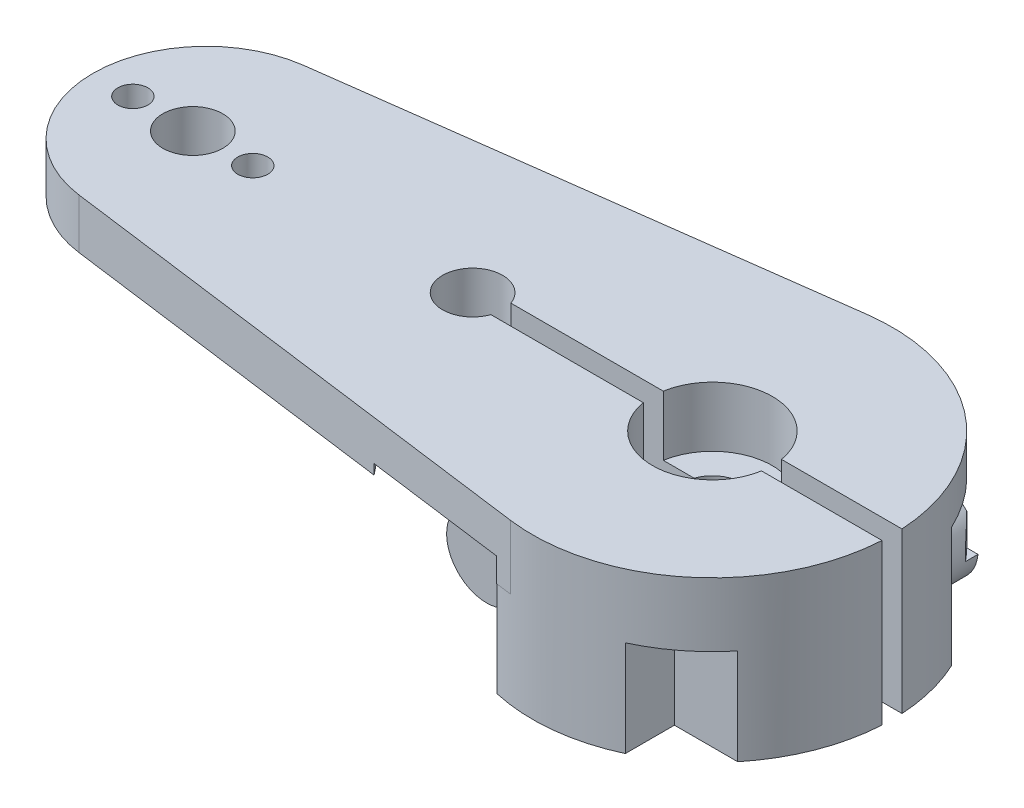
from build123d import *
from build123d.topology import SkipClean

# Parameters (mm, degrees)
ESQUISSE1_R                    = 0.75
BOSS_EXTRU_1_DEPTH             = 2.5
BOSS_EXTRU_2_START             = 0.7
BOSS_EXTRU_2_DEPTH             = 0.7
BOSS_EXTRU_3_START             = 4.8
ESQUISSE3_R                    = 9
BOSS_EXTRU_3_DEPTH             = 4.8
ENL_V_MAT_EXTRU_1_DEPTH        = 0.5
ENL_V_MAT_EXTRU_2_DEPTH        = 44.69210455
ESQUISSE6_R                    = 3
ENL_V_MAT_EXTRU_3_DEPTH        = 3
ESQUISSE7_R                    = 1.5
ENL_V_MAT_EXTRU_4_DEPTH        = 44.243496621
ENL_V_START                    = -3.5
ESQUISSE8_R                    = 3
ENL_V_MAT_EXTRU_5_DEPTH        = 3.5
ENL_V_MAT_EXTRU_6_DEPTH        = 4.8
ENL_V_MAT_EXTRU_7_DEPTH        = 1.2
BOSS_EXTRU_4_REACH             = 45.304
ESQUISSE11_R                   = 1.25
BOSS_EXTRU_4_DIRECTION_2_REACH = 45.304
ESQUISSE12_R                   = 2
BOSS_EXTRU_5_DEPTH             = 2.5
ESQUISSE13_R                   = 2
BOSS_EXTRU_6_DEPTH             = 2.5
ENL_V_MAT_EXTRU_8_DEPTH        = 2.5
ENL_V_MAT_EXTRU_8_DEPTH_BACK   = 44.304156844
ESQUISSE15_R                   = 1.5
ENL_V_MAT_EXTRU_9_DEPTH        = 44.69210455


with BuildPart() as part:
    # Esquisse1 → Boss.-Extru.1 (new body)
    with BuildSketch(Plane(origin=(0, 0, 0), x_dir=(1, 0, 0), z_dir=(0, 1, 0))):
        with BuildLine():
            Line((-38.526315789, 3.965222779), (-1.184210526, 8.921751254))
            ThreePointArc((-1.184210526, 8.921751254), (0, 9), (1.184210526, 8.921751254))
            Line((1.184210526, 8.921751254), (38.526315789, 3.965222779))
            ThreePointArc((38.526315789, 3.965222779), (42, 0), (38.526315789, -3.965222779))
            Line((38.526315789, -3.965222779), (1.184210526, -8.921751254))
            ThreePointArc((1.184210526, -8.921751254), (0, -9), (-1.184210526, -8.921751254))
            Line((-1.184210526, -8.921751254), (-38.526315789, -3.965222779))
            ThreePointArc((-38.526315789, -3.965222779), (-42, 0), (-38.526315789, 3.965222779))
        make_face()
        with Locations(Location((-38, 0, 0), (0, 0, 270))):
            Circle(ESQUISSE1_R, mode=Mode.SUBTRACT)
        with Locations(Location((-35, 0, 0), (0, 0, 270))):
            Circle(ESQUISSE1_R, mode=Mode.SUBTRACT)
        with Locations(Location((-32, 0, 0), (0, 0, 270))):
            Circle(ESQUISSE1_R, mode=Mode.SUBTRACT)
        with Locations(Location((-29, 0, 0), (0, 0, 270))):
            Circle(ESQUISSE1_R, mode=Mode.SUBTRACT)
        with Locations(Location((-26, 0, 0), (0, 0, 270))):
            Circle(ESQUISSE1_R, mode=Mode.SUBTRACT)
        with Locations(Location((-23, 0, 0), (0, 0, 270))):
            Circle(ESQUISSE1_R, mode=Mode.SUBTRACT)
        with Locations(Location((23, 0, 0), (0, 0, 90))):
            Circle(ESQUISSE1_R, mode=Mode.SUBTRACT)
        with Locations(Location((26, 0, 0), (0, 0, 90))):
            Circle(ESQUISSE1_R, mode=Mode.SUBTRACT)
        with Locations(Location((29, 0, 0), (0, 0, 90))):
            Circle(ESQUISSE1_R, mode=Mode.SUBTRACT)
        with Locations(Location((32, 0, 0), (0, 0, 90))):
            Circle(ESQUISSE1_R, mode=Mode.SUBTRACT)
        with Locations(Location((35, 0, 0), (0, 0, 90))):
            Circle(ESQUISSE1_R, mode=Mode.SUBTRACT)
        with Locations(Location((38, 0, 0), (0, 0, 90))):
            Circle(ESQUISSE1_R, mode=Mode.SUBTRACT)
    extrude(amount=BOSS_EXTRU_1_DEPTH)

    # Esquisse2 → Boss.-Extru.2 (add)
    with BuildSketch(Plane.XZ.offset(BOSS_EXTRU_2_START)):
        with BuildLine():
            Line((-5.505211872, 8.348211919), (-1.184210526, 8.921751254))
            ThreePointArc((-1.184210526, 8.921751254), (0, 9), (1.184210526, 8.921751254))
            Line((1.184210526, 8.921751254), (5.505211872, 8.348211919))
            ThreePointArc((5.505211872, 8.348211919), (10, 0), (5.505211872, -8.348211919))
            Line((5.505211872, -8.348211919), (1.184210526, -8.921751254))
            ThreePointArc((1.184210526, -8.921751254), (0, -9), (-1.184210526, -8.921751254))
            Line((-1.184210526, -8.921751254), (-5.505211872, -8.348211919))
            ThreePointArc((-5.505211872, -8.348211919), (-10, 0), (-5.505211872, 8.348211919))
        make_face()
    extrude(amount=-BOSS_EXTRU_2_DEPTH)

    # Esquisse3 → Boss.-Extru.3 (add)
    with BuildSketch(Plane.XZ.offset(0.7).offset(BOSS_EXTRU_3_START)):
        with Locations(Location((0, 0, 0), (0, 0, 270))):
            Circle(ESQUISSE3_R)
    extrude(amount=-BOSS_EXTRU_3_DEPTH)

    # Esquisse4 → Enl_v. mat.-Extru.1 (cut)
    with SkipClean():  # the faces are left unmerged after this step: merging them gives an invalid solid
        with BuildSketch(Plane.XZ):
            with BuildLine():
                Line((-9.052455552, 7.877375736), (-5.505211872, 8.348211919))
                ThreePointArc((-5.505211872, 8.348211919), (-10, 0), (-5.505211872, -8.348211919))
                Line((-5.505211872, -8.348211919), (-9.052455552, -7.877375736))
                ThreePointArc((-9.052455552, -7.877375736), (-12, 0), (-9.052455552, 7.877375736))
            make_face()
            with BuildLine():
                Line((9.052455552, -7.877375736), (5.505211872, -8.348211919))
                ThreePointArc((5.505211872, -8.348211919), (10, 0), (5.505211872, 8.348211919))
                Line((5.505211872, 8.348211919), (9.052455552, 7.877375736))
                ThreePointArc((9.052455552, 7.877375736), (12, 0), (9.052455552, -7.877375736))
            make_face()
        extrude(amount=-ENL_V_MAT_EXTRU_1_DEPTH, mode=Mode.SUBTRACT)

    # Esquisse5 → Enl_v. mat.-Extru.2 (cut, through all)
    with BuildSketch(Plane(origin=(0, 2.5, 0), x_dir=(1, 0, 0), z_dir=(0, 1, 0))):
        with BuildLine():
            Line((-10.585786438, 0.5), (10.585786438, 0.5))
            ThreePointArc((10.585786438, 0.5), (13.5, 0), (10.585786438, -0.5))
            Line((10.585786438, -0.5), (-10.585786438, -0.5))
            ThreePointArc((-10.585786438, -0.5), (-13.5, 0), (-10.585786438, 0.5))
        make_face()
    extrude(amount=-ENL_V_MAT_EXTRU_2_DEPTH, mode=Mode.SUBTRACT)

    # Esquisse6 → Enl_v. mat.-Extru.3 (cut)
    with BuildSketch(Plane(origin=(0, 2.5, 0), x_dir=(1, 0, 0), z_dir=(0, 1, 0))):
        Circle(ESQUISSE6_R)
    extrude(amount=-ENL_V_MAT_EXTRU_3_DEPTH, mode=Mode.SUBTRACT)

    # Esquisse7 → Enl_v. mat.-Extru.4 (cut, through all)
    with BuildSketch(Plane(origin=(0, -0.5, 0), x_dir=(1, 0, 0), z_dir=(0, 1, 0))):
        Circle(ESQUISSE7_R)
    extrude(amount=-ENL_V_MAT_EXTRU_4_DEPTH, mode=Mode.SUBTRACT)

    # Esquisse8 → Enl_v. mat.-Extru.5 (cut)
    with BuildSketch(Plane.XZ.offset(5.5).offset(ENL_V_START)):
        Circle(ESQUISSE8_R)
    extrude(amount=ENL_V_MAT_EXTRU_5_DEPTH, mode=Mode.SUBTRACT)

    # Esquisse9 → Enl_v. mat.-Extru.6 (cut)
    with BuildSketch(Plane.XZ.offset(5.5)):
        with BuildLine():
            Line((-8.158431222, 3.8), (-2, 3.8))
            Line((-2, 3.8), (-2, 8.774964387))
            ThreePointArc((-2, 8.774964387), (-5.655616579, 7.001000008), (-8.158431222, 3.8))
        make_face()
        with BuildLine():
            Line((3.8, 8.158431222), (3.8, 5.7))
            Line((3.8, 5.7), (6.96491206, 5.7))
            ThreePointArc((6.96491206, 5.7), (5.521032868, 7.107615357), (3.8, 8.158431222))
        make_face()
        with BuildLine():
            Line((-6.96491206, -5.7), (-3.8, -5.7))
            Line((-3.8, -5.7), (-3.8, -8.158431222))
            ThreePointArc((-3.8, -8.158431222), (-5.521032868, -7.107615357), (-6.96491206, -5.7))
        make_face()
        with BuildLine():
            Line((2, -8.774964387), (2, -3.8))
            Line((2, -3.8), (8.158431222, -3.8))
            ThreePointArc((8.158431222, -3.8), (5.655616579, -7.001000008), (2, -8.774964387))
        make_face()
    extrude(amount=-ENL_V_MAT_EXTRU_6_DEPTH, mode=Mode.SUBTRACT)

    # Esquisse10 → Enl_v. mat.-Extru.7 (cut)
    with BuildSketch(Plane.XZ.offset(0.7)):
        with BuildLine():
            Line((9.249864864, -3.8), (2, -3.8))
            Line((2, -3.8), (2, -8.813469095))
            Line((2, -8.813469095), (5.505211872, -8.348211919))
            ThreePointArc((5.505211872, -8.348211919), (7.720079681, -6.356128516), (9.249864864, -3.8))
        make_face()
        with BuildLine():
            Line((-9.249864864, 3.8), (-2, 3.8))
            Line((-2, 3.8), (-2, 8.813469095))
            Line((-2, 8.813469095), (-5.505211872, 8.348211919))
            ThreePointArc((-5.505211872, 8.348211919), (-7.720079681, 6.356128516), (-9.249864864, 3.8))
        make_face()
    extrude(amount=-ENL_V_MAT_EXTRU_7_DEPTH, mode=Mode.SUBTRACT)

    # Boss.-Extru.4: up to this face of the body (flat: up to its plane)
    boss_extru_4_end = Plane(part.part.faces().sort_by_distance((-6.111460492, -1.284144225, -0.5))[0])
    # Esquisse11 → Boss.-Extru.4 (add, up to the picked face)
    with BuildSketch(Plane.XY, mode=Mode.PRIVATE) as boss_extru_4_sk1:
        with Locations((-5, -2.3)):
            Circle(ESQUISSE11_R)
    boss_extru_4_tool1 = split(extrude(boss_extru_4_sk1.sketch, amount=-BOSS_EXTRU_4_REACH, mode=Mode.PRIVATE), bisect_by=boss_extru_4_end, keep=Keep.BOTH, mode=Mode.PRIVATE)
    # Esquisse11 → Boss.-Extru.4 (add, up to the picked face)
    with BuildSketch(Plane.XY, mode=Mode.PRIVATE) as boss_extru_4_sk2:
        with Locations((5, -2.3)):
            Circle(ESQUISSE11_R)
    boss_extru_4_tool2 = split(extrude(boss_extru_4_sk2.sketch, amount=-BOSS_EXTRU_4_REACH, mode=Mode.PRIVATE), bisect_by=boss_extru_4_end, keep=Keep.BOTH, mode=Mode.PRIVATE)
    add(boss_extru_4_tool1.solids().sort_by(Axis((-5, -2.3, 0), (0, 0, -1)))[0])
    add(boss_extru_4_tool2.solids().sort_by(Axis((5, -2.3, 0), (0, 0, -1)))[0])

    # Boss.-Extru.4 direction 2: up to this face of the body (flat: up to its plane)
    boss_extru_4_direction_2_end = Plane(part.part.faces().sort_by_distance((-6.111460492, -1.284144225, 0.5))[0])
    # Esquisse11 → Boss.-Extru.4 direction 2 (add, up to the picked face)
    with BuildSketch(Plane.XY, mode=Mode.PRIVATE) as boss_extru_4_direction_2_sk1:
        with Locations((-5, -2.3)):
            Circle(ESQUISSE11_R)
    boss_extru_4_direction_2_tool1 = split(extrude(boss_extru_4_direction_2_sk1.sketch, amount=BOSS_EXTRU_4_DIRECTION_2_REACH, mode=Mode.PRIVATE), bisect_by=boss_extru_4_direction_2_end, keep=Keep.BOTH, mode=Mode.PRIVATE)
    # Esquisse11 → Boss.-Extru.4 direction 2 (add, up to the picked face)
    with BuildSketch(Plane.XY, mode=Mode.PRIVATE) as boss_extru_4_direction_2_sk2:
        with Locations((5, -2.3)):
            Circle(ESQUISSE11_R)
    boss_extru_4_direction_2_tool2 = split(extrude(boss_extru_4_direction_2_sk2.sketch, amount=BOSS_EXTRU_4_DIRECTION_2_REACH, mode=Mode.PRIVATE), bisect_by=boss_extru_4_direction_2_end, keep=Keep.BOTH, mode=Mode.PRIVATE)
    add(boss_extru_4_direction_2_tool1.solids().sort_by(Axis((-5, -2.3, 0), (0, 0, 1)))[0])
    add(boss_extru_4_direction_2_tool2.solids().sort_by(Axis((5, -2.3, 0), (0, 0, 1)))[0])

    # Esquisse12 → Boss.-Extru.5 (add)
    with BuildSketch(Plane.XY.offset(3.8)):
        with Locations(Location((-5, -2.3, 0), (0, 0, 180))):
            Circle(ESQUISSE12_R)
    extrude(amount=BOSS_EXTRU_5_DEPTH)

    # Esquisse13 → Boss.-Extru.6 (add)
    with BuildSketch(Plane(origin=(0, 0, -3.8), x_dir=(-1, 0, 0), z_dir=(0, 0, -1))):
        with Locations(Location((-5, -2.3, 0), (0, 0, 180))):
            Circle(ESQUISSE13_R)
    extrude(amount=BOSS_EXTRU_6_DEPTH)

    # Esquisse14 → Enl_v. mat.-Extru.8 (cut, two sides: drawn at the far end of the back side and taken through both)
    with SkipClean():  # the faces are left unmerged after this step: merging them gives an invalid solid
        with BuildSketch(Plane.XZ.offset(-ENL_V_MAT_EXTRU_8_DEPTH_BACK)):
            with BuildLine():
                Line((1.184210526, -8.921751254), (38.526315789, -3.965222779))
                ThreePointArc((38.526315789, -3.965222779), (42, 0), (38.526315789, 3.965222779))
                Line((38.526315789, 3.965222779), (1.184210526, 8.921751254))
                ThreePointArc((1.184210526, 8.921751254), (9, 0), (1.184210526, -8.921751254))
            make_face()
        extrude(amount=ENL_V_MAT_EXTRU_8_DEPTH + ENL_V_MAT_EXTRU_8_DEPTH_BACK, mode=Mode.SUBTRACT)

    # Esquisse15 → Enl_v. mat.-Extru.9 (cut, through all)
    with SkipClean():  # the faces are left unmerged after this step: merging them gives an invalid solid
        with BuildSketch(Plane(origin=(0, 2.5, 0), x_dir=(1, 0, 0), z_dir=(0, 1, 0))):
            with Locations(Location((-26, 0, 0), (0, 0, 270))):
                Circle(ESQUISSE15_R)
            with BuildLine():
                Line((-26.078947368, 5.617398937), (-38.526315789, 3.965222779))
                ThreePointArc((-38.526315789, 3.965222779), (-42, 0), (-38.526315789, -3.965222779))
                Line((-38.526315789, -3.965222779), (-26.078947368, -5.617398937))
                ThreePointArc((-26.078947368, -5.617398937), (-31, 0), (-26.078947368, 5.617398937))
            make_face()
        extrude(amount=-ENL_V_MAT_EXTRU_9_DEPTH, mode=Mode.SUBTRACT)


solid = part.part
